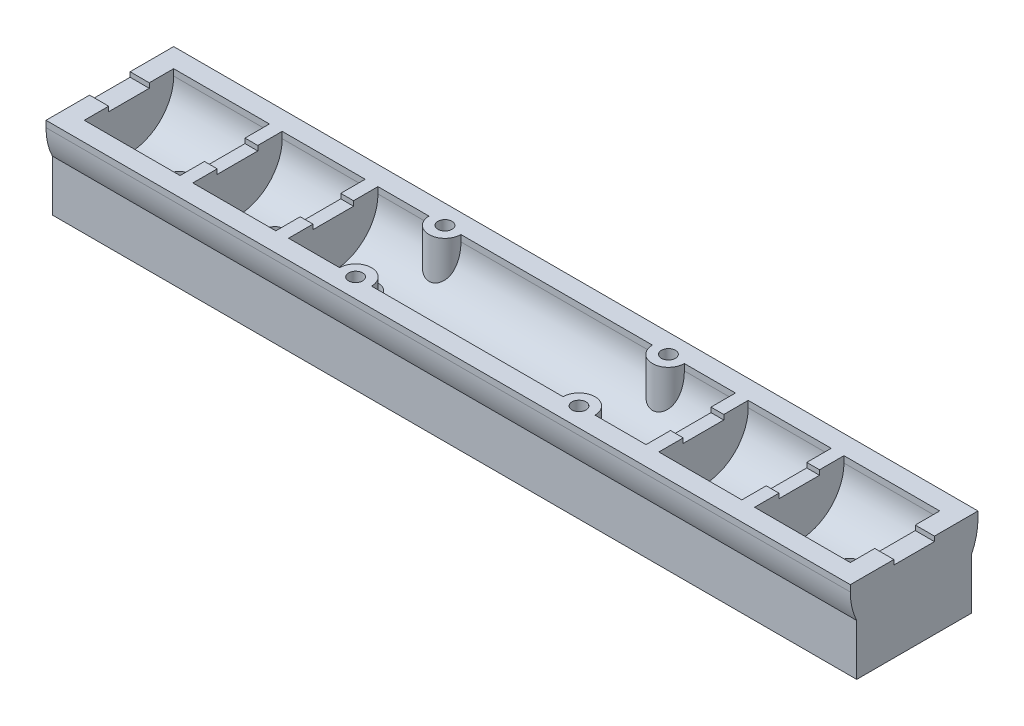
from build123d import *

# Parameters (mm, degrees)
BOSS_EXTRUDE1_DEPTH       = 120
BOSS_EXTRUDE3_DEPTH       = 3
SKETCH4_W                 = 126
SKETCH4_H                 = 20
SKETCH4_W_2               = 120
SKETCH4_H_2               = 14
BOSS_EXTRUDE4_DEPTH       = 1
SKETCH7_R                 = 1.7
CUT_EXTRUDE3_DEPTH        = 125.126790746
LPATTERN2_COUNT           = 2
LPATTERN2_PITCH           = 15
SKETCH8_R                 = 1.7
CUT_EXTRUDE4_DEPTH        = 125.126790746
LPATTERN3_COUNT           = 3
LPATTERN3_PITCH           = 15
BOSS_EXTRUDE5_DEPTH       = 2
LPATTERN4_COUNT           = 2
LPATTERN4_PITCH           = 15
MIRROR2_COPY_1_DEPTH      = 2
CUT_EXTRUDE5_REACH        = 128.999
SKETCH9_W                 = 6.35
SKETCH9_H                 = 0.75
BOSS_EXTRUDE6_REACH       = 126.127
SKETCH11_R                = 1.1
CUT_EXTRUDE6_DEPTH        = 1.7
LPATTERN5_COUNT           = 2
LPATTERN5_PITCH           = 35
LPATTERN5_COPY_1_REACH    = 126.127
LPATTERN5_COPY_2_SKETCH_R = 1.1
LPATTERN5_COPY_2_DEPTH    = 1.7


with BuildPart() as part:
    # Sketch1 → Boss-Extrude1 (new body)
    with BuildSketch(Plane(origin=(0, 0, 0), x_dir=(0, 0, -1), z_dir=(1, 0, 0))):
        with BuildLine():
            ThreePointArc((-7, 0), (0, -7), (7, 0))
            Line((7, 0), (10, 0))
            ThreePointArc((10, 0), (0, -10), (-10, 0))
            Line((-10, 0), (-7, 0))
        make_face()
        with BuildLine():
            ThreePointArc((9, -4.358898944), (0, -10), (-9, -4.358898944))
            Line((-9, -4.358898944), (-9, -12.358898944))
            Line((-9, -12.358898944), (9, -12.358898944))
            Line((9, -12.358898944), (9, -4.358898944))
        make_face()
    extrude(amount=BOSS_EXTRUDE1_DEPTH)

    # Sketch2 → Boss-Extrude3 (add)
    with BuildSketch(Plane(origin=(120, 0, 0), x_dir=(0, 0, -1), z_dir=(1, 0, 0))):
        with BuildLine():
            ThreePointArc((9, -4.358898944), (0, -10), (-9, -4.358898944))
            Line((-9, -4.358898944), (-9, -12.358898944))
            Line((-9, -12.358898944), (9, -12.358898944))
            Line((9, -12.358898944), (9, -4.358898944))
        make_face()
        with BuildLine():
            Line((-7, 0), (-10, 0))
            ThreePointArc((-10, 0), (-9.746794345, -2.236067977), (-9, -4.358898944))
            ThreePointArc((-9, -4.358898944), (0, -10), (9, -4.358898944))
            ThreePointArc((9, -4.358898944), (9.746794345, -2.236067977), (10, 0))
            Line((10, 0), (7, 0))
            ThreePointArc((7, 0), (0, -7), (-7, 0))
        make_face()
        with BuildLine():
            Line((7, 0), (-7, 0))
            ThreePointArc((-7, 0), (0, -7), (7, 0))
        make_face()
    boss_extrude3 = extrude(amount=BOSS_EXTRUDE3_DEPTH)

    # Mirror1: Boss-Extrude3 across plane
    add(boss_extrude3.mirror(Plane(origin=(60, 0, 0), x_dir=(0, 0, 1), z_dir=(1, 0, 0))))

    # Sketch4 → Boss-Extrude4 (add)
    with BuildSketch(Plane(origin=(0, 0, 0), x_dir=(1, 0, 0), z_dir=(0, 1, 0))):
        with Locations((60, 0)):
            Rectangle(SKETCH4_W, SKETCH4_H)
        with Locations((60, 0)):
            Rectangle(SKETCH4_W_2, SKETCH4_H_2, mode=Mode.SUBTRACT)
    extrude(amount=BOSS_EXTRUDE4_DEPTH)

    # Sketch7 → Cut-Extrude3 (cut, through all)
    with BuildSketch(Plane.XZ.offset(12.358898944)):
        with Locations(Location((112.5, 0, 0), (0, 0, 270))):
            Circle(SKETCH7_R)
    cut_extrude3 = extrude(amount=-CUT_EXTRUDE3_DEPTH, mode=Mode.SUBTRACT)

    # LPattern2: Cut-Extrude3 ×2
    with Locations(*[(-i * LPATTERN2_PITCH, 0, 0) for i in range(1, LPATTERN2_COUNT)]):
        add(cut_extrude3, mode=Mode.SUBTRACT)

    # Sketch8 → Cut-Extrude4 (cut, through all)
    with BuildSketch(Plane.XZ.offset(12.358898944)):
        with Locations(Location((7.5, 0, 0), (0, 0, 270))):
            Circle(SKETCH8_R)
    cut_extrude4 = extrude(amount=-CUT_EXTRUDE4_DEPTH, mode=Mode.SUBTRACT)

    # LPattern3: Cut-Extrude4 ×3
    with Locations(*[(i * LPATTERN3_PITCH, 0, 0) for i in range(1, LPATTERN3_COUNT)]):
        add(cut_extrude4, mode=Mode.SUBTRACT)

    # Sketch6 → Boss-Extrude5 (add)
    with BuildSketch(Plane(origin=(15, 0, 0), x_dir=(0, 0, -1), z_dir=(1, 0, 0))):
        with BuildLine():
            Line((9, 1), (9, 0))
            ThreePointArc((9, 0), (0, -9), (-9, 0))
            Line((-9, 0), (-9, 1))
            Line((-9, 1), (-3.175, 1))
            Line((-3.175, 1), (-3.175, 0.25))
            Line((-3.175, 0.25), (3.175, 0.25))
            Line((3.175, 0.25), (3.175, 1))
            Line((3.175, 1), (9, 1))
        make_face()
    boss_extrude5 = extrude(amount=BOSS_EXTRUDE5_DEPTH)

    # LPattern4: Boss-Extrude5 ×2
    with Locations(*[(i * LPATTERN4_PITCH, 0, 0) for i in range(1, LPATTERN4_COUNT)]):
        add(boss_extrude5)

    # Mirror2: Boss-Extrude5 across plane
    add(boss_extrude5.mirror(Plane(origin=(60, 0, 0), x_dir=(0, 0, 1), z_dir=(1, 0, 0))))

    # Mirror2 copy 1 sketch → Mirror2 copy 1 (add)
    with BuildSketch(Plane(origin=(90, 0, 0), x_dir=(0, 0, -1), z_dir=(-1, 0, 0))):
        with BuildLine():
            Line((9, -1), (9, 0))
            ThreePointArc((9, 0), (0, 9), (-9, 0))
            Line((-9, 0), (-9, -1))
            Line((-9, -1), (-3.175, -1))
            Line((-3.175, -1), (-3.175, -0.25))
            Line((-3.175, -0.25), (3.175, -0.25))
            Line((3.175, -0.25), (3.175, -1))
            Line((3.175, -1), (9, -1))
        make_face()
    extrude(amount=MIRROR2_COPY_1_DEPTH)

    # Sketch9 → Cut-Extrude5 (cut, up to next)
    with BuildSketch(Plane.ZY.offset(3), mode=Mode.PRIVATE) as cut_extrude5_sk1:
        with Locations((0, 0.625)):
            Rectangle(SKETCH9_W, SKETCH9_H)
    cut_extrude5_tool1 = extrude(cut_extrude5_sk1.sketch, amount=-CUT_EXTRUDE5_REACH, mode=Mode.PRIVATE) & part.part
    cut_extrude5 = cut_extrude5_tool1.solids().sort_by_distance((-3, 0.625, 0))[0]
    add(cut_extrude5, mode=Mode.SUBTRACT)

    # Mirror3: Cut-Extrude5 across plane
    add(cut_extrude5.mirror(Plane(origin=(60, 0, 0), x_dir=(0, 0, 1), z_dir=(1, 0, 0))), mode=Mode.SUBTRACT)

    # Sketch10 → Boss-Extrude6 (add, up to next)
    with BuildSketch(Plane(origin=(0, 1, 0), x_dir=(1, 0, 0), z_dir=(0, 1, 0)), mode=Mode.PRIVATE) as boss_extrude6_sk1:
        with BuildLine():
            Line((40, -7), (45, -7))
            ThreePointArc((45, -7), (42.5, -4.5), (40, -7))
        make_face()
    boss_extrude6_tool1 = extrude(boss_extrude6_sk1.sketch, amount=-BOSS_EXTRUDE6_REACH, mode=Mode.PRIVATE) - part.part
    boss_extrude6 = boss_extrude6_tool1.solids().sort_by_distance((42.5, 1, 5.938967))[0]
    add(boss_extrude6)

    # Sketch11 → Cut-Extrude6 (cut)
    with BuildSketch(Plane(origin=(0, 1, 0), x_dir=(1, 0, 0), z_dir=(0, 1, 0))):
        with Locations(Location((42.5, -7, 0), (0, 0, 270))):
            Circle(SKETCH11_R)
    cut_extrude6 = extrude(amount=-CUT_EXTRUDE6_DEPTH, mode=Mode.SUBTRACT)

    # Mirror4: Boss-Extrude6, Cut-Extrude6 across plane
    add(boss_extrude6.mirror(Plane.XY))
    add(cut_extrude6.mirror(Plane.XY), mode=Mode.SUBTRACT)

    # LPattern5: Boss-Extrude6, Cut-Extrude6 ×2
    with Locations(*[(i * LPATTERN5_PITCH, 0, 0) for i in range(1, LPATTERN5_COUNT)]):
        add(boss_extrude6)
        add(cut_extrude6, mode=Mode.SUBTRACT)

    # LPattern5 copy 1 sketch → LPattern5 copy 1 (add, up to next)
    with BuildSketch(Plane(origin=(35, 1, 0), x_dir=(1, 0, 0), z_dir=(0, 1, 0)), mode=Mode.PRIVATE) as lpattern5_copy_1_sk1:
        with BuildLine():
            Line((40, 7), (45, 7))
            ThreePointArc((45, 7), (42.5, 4.5), (40, 7))
        make_face()
    lpattern5_copy_1_tool1 = extrude(lpattern5_copy_1_sk1.sketch, amount=-LPATTERN5_COPY_1_REACH, mode=Mode.PRIVATE) - part.part
    add(lpattern5_copy_1_tool1.solids().sort_by_distance((77.5, 1, -5.938967))[0])

    # LPattern5 copy 2 sketch → LPattern5 copy 2 (cut)
    with BuildSketch(Plane(origin=(35, 1, 0), x_dir=(1, 0, 0), z_dir=(0, 1, 0))):
        with Locations((42.5, 7)):
            Circle(LPATTERN5_COPY_2_SKETCH_R)
    extrude(amount=-LPATTERN5_COPY_2_DEPTH, mode=Mode.SUBTRACT)


solid = part.part
